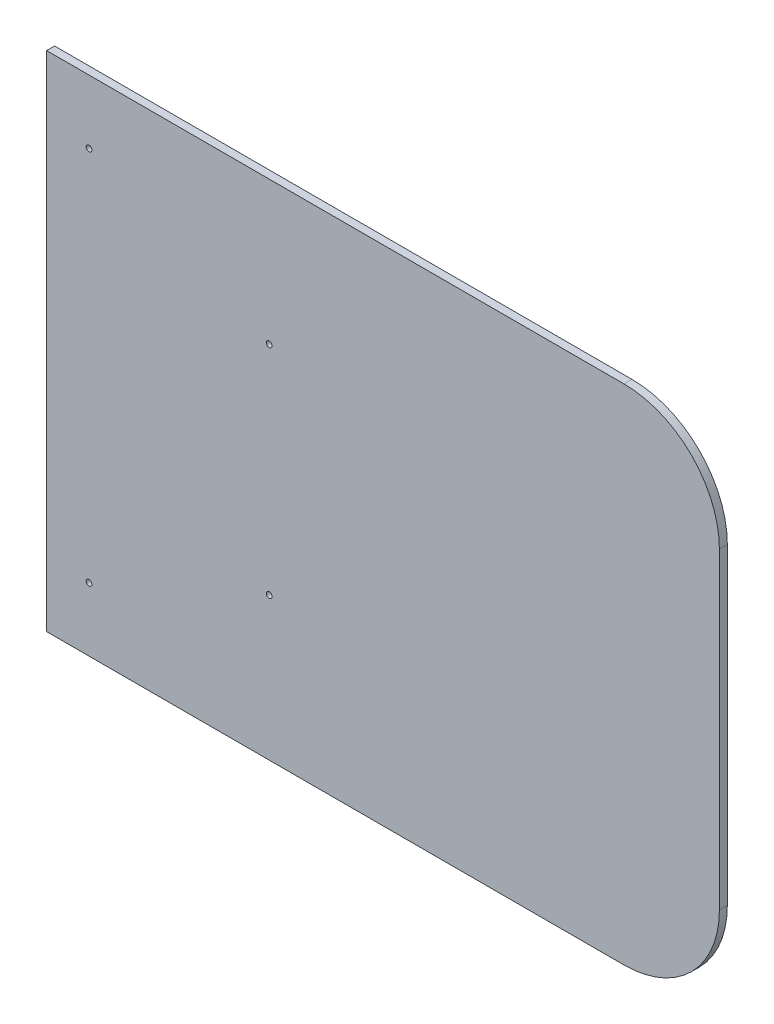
ISO-10303-21;
HEADER;
FILE_DESCRIPTION(('STEP AP214'),'2;1');
FILE_NAME('part.step','',(''),(''),'','','');
FILE_SCHEMA(('AUTOMOTIVE_DESIGN { 1 0 10303 214 1 1 1 1 }'));
ENDSEC;
DATA;
#1=APPLICATION_CONTEXT('core data for automotive mechanical design processes');
#2=APPLICATION_PROTOCOL_DEFINITION('international standard','automotive_design',2000,#1);
#3=PRODUCT_CONTEXT('',#1,'mechanical');
#4=PRODUCT('Part','Part','',(#3));
#5=PRODUCT_RELATED_PRODUCT_CATEGORY('part','',(#4));
#6=PRODUCT_DEFINITION_FORMATION('','',#4);
#7=PRODUCT_DEFINITION_CONTEXT('part definition',#1,'design');
#8=PRODUCT_DEFINITION('design','',#6,#7);
#9=PRODUCT_DEFINITION_SHAPE('','',#8);
#10=(LENGTH_UNIT() NAMED_UNIT(*) SI_UNIT(.MILLI.,.METRE.));
#11=(NAMED_UNIT(*) PLANE_ANGLE_UNIT() SI_UNIT($,.RADIAN.));
#12=(NAMED_UNIT(*) SI_UNIT($,.STERADIAN.) SOLID_ANGLE_UNIT());
#13=UNCERTAINTY_MEASURE_WITH_UNIT(LENGTH_MEASURE(1.E-05),#10,'distance_accuracy_value','');
#14=(GEOMETRIC_REPRESENTATION_CONTEXT(3) GLOBAL_UNCERTAINTY_ASSIGNED_CONTEXT((#13)) GLOBAL_UNIT_ASSIGNED_CONTEXT((#10,
#11,#12)) REPRESENTATION_CONTEXT('',''));
#15=CARTESIAN_POINT('',(0.,0.,0.));
#16=DIRECTION('',(0.,0.,1.));
#17=DIRECTION('',(1.,0.,0.));
#18=AXIS2_PLACEMENT_3D('',#15,#16,#17);
#19=CARTESIAN_POINT('',(403.225,-301.625,4.7625));
#20=DIRECTION('',(-1.,0.,0.));
#21=DIRECTION('',(0.,0.,1.));
#22=AXIS2_PLACEMENT_3D('',#19,#20,#21);
#23=PLANE('',#22);
#24=DIRECTION('',(0.,1.,0.));
#25=VECTOR('',#24,1.);
#26=CARTESIAN_POINT('',(403.225,-301.625,-4.7625));
#27=LINE('',#26,#25);
#28=CARTESIAN_POINT('',(403.225,-187.325,-4.7625));
#29=VERTEX_POINT('',#28);
#30=CARTESIAN_POINT('',(403.225,187.325,-4.7625));
#31=VERTEX_POINT('',#30);
#32=EDGE_CURVE('E113',#29,#31,#27,.T.);
#33=ORIENTED_EDGE('',*,*,#32,.T.);
#34=DIRECTION('',(0.,0.,-1.));
#35=VECTOR('',#34,1.);
#36=CARTESIAN_POINT('',(403.225,187.325,4.7625));
#37=LINE('',#36,#35);
#38=CARTESIAN_POINT('',(403.225,187.325,4.7625));
#39=VERTEX_POINT('',#38);
#40=EDGE_CURVE('E51',#31,#39,#37,.F.);
#41=ORIENTED_EDGE('',*,*,#40,.T.);
#42=DIRECTION('',(0.,1.,0.));
#43=VECTOR('',#42,1.);
#44=CARTESIAN_POINT('',(403.225,-301.625,4.7625));
#45=LINE('',#44,#43);
#46=CARTESIAN_POINT('',(403.225,-187.325,4.7625));
#47=VERTEX_POINT('',#46);
#48=EDGE_CURVE('E94',#47,#39,#45,.T.);
#49=ORIENTED_EDGE('',*,*,#48,.F.);
#50=DIRECTION('',(0.,0.,-1.));
#51=VECTOR('',#50,1.);
#52=CARTESIAN_POINT('',(403.225,-187.325,4.7625));
#53=LINE('',#52,#51);
#54=EDGE_CURVE('E127',#47,#29,#53,.T.);
#55=ORIENTED_EDGE('',*,*,#54,.T.);
#56=EDGE_LOOP('',(#33,#41,#49,#55));
#57=FACE_BOUND('',#56,.T.);
#58=ADVANCED_FACE('F30',(#57),#23,.F.);
#59=CARTESIAN_POINT('',(-403.225,301.625,4.7625));
#60=DIRECTION('',(0.,-1.,0.));
#61=DIRECTION('',(0.,0.,-1.));
#62=AXIS2_PLACEMENT_3D('',#59,#60,#61);
#63=PLANE('',#62);
#64=DIRECTION('',(-1.,0.,0.));
#65=VECTOR('',#64,1.);
#66=CARTESIAN_POINT('',(-403.225,301.625,4.7625));
#67=LINE('',#66,#65);
#68=CARTESIAN_POINT('',(288.925,301.625,4.7625));
#69=VERTEX_POINT('',#68);
#70=CARTESIAN_POINT('',(-403.225,301.625,4.7625));
#71=VERTEX_POINT('',#70);
#72=EDGE_CURVE('E84',#69,#71,#67,.T.);
#73=ORIENTED_EDGE('',*,*,#72,.F.);
#74=DIRECTION('',(0.,0.,-1.));
#75=VECTOR('',#74,1.);
#76=CARTESIAN_POINT('',(288.925,301.625,4.7625));
#77=LINE('',#76,#75);
#78=CARTESIAN_POINT('',(288.925,301.625,-4.7625));
#79=VERTEX_POINT('',#78);
#80=EDGE_CURVE('E103',#69,#79,#77,.T.);
#81=ORIENTED_EDGE('',*,*,#80,.T.);
#82=DIRECTION('',(-1.,0.,0.));
#83=VECTOR('',#82,1.);
#84=CARTESIAN_POINT('',(-403.225,301.625,-4.7625));
#85=LINE('',#84,#83);
#86=CARTESIAN_POINT('',(-403.225,301.625,-4.7625));
#87=VERTEX_POINT('',#86);
#88=EDGE_CURVE('E100',#79,#87,#85,.T.);
#89=ORIENTED_EDGE('',*,*,#88,.T.);
#90=DIRECTION('',(0.,0.,-1.));
#91=VECTOR('',#90,1.);
#92=CARTESIAN_POINT('',(-403.225,301.625,4.7625));
#93=LINE('',#92,#91);
#94=EDGE_CURVE('E97',#71,#87,#93,.T.);
#95=ORIENTED_EDGE('',*,*,#94,.F.);
#96=EDGE_LOOP('',(#73,#81,#89,#95));
#97=FACE_BOUND('',#96,.T.);
#98=ADVANCED_FACE('F98',(#97),#63,.F.);
#99=CARTESIAN_POINT('',(-403.225,-301.625,4.7625));
#100=DIRECTION('',(1.,0.,0.));
#101=DIRECTION('',(0.,0.,-1.));
#102=AXIS2_PLACEMENT_3D('',#99,#100,#101);
#103=PLANE('',#102);
#104=DIRECTION('',(0.,-1.,0.));
#105=VECTOR('',#104,1.);
#106=CARTESIAN_POINT('',(-403.225,-301.625,-4.7625));
#107=LINE('',#106,#105);
#108=CARTESIAN_POINT('',(-403.225,-301.625,-4.7625));
#109=VERTEX_POINT('',#108);
#110=EDGE_CURVE('E117',#87,#109,#107,.T.);
#111=ORIENTED_EDGE('',*,*,#110,.T.);
#112=DIRECTION('',(0.,0.,-1.));
#113=VECTOR('',#112,1.);
#114=CARTESIAN_POINT('',(-403.225,-301.625,4.7625));
#115=LINE('',#114,#113);
#116=CARTESIAN_POINT('',(-403.225,-301.625,4.7625));
#117=VERTEX_POINT('',#116);
#118=EDGE_CURVE('E104',#117,#109,#115,.T.);
#119=ORIENTED_EDGE('',*,*,#118,.F.);
#120=DIRECTION('',(0.,-1.,0.));
#121=VECTOR('',#120,1.);
#122=CARTESIAN_POINT('',(-403.225,-301.625,4.7625));
#123=LINE('',#122,#121);
#124=EDGE_CURVE('E88',#71,#117,#123,.T.);
#125=ORIENTED_EDGE('',*,*,#124,.F.);
#126=ORIENTED_EDGE('',*,*,#94,.T.);
#127=EDGE_LOOP('',(#111,#119,#125,#126));
#128=FACE_BOUND('',#127,.T.);
#129=ADVANCED_FACE('F106',(#128),#103,.F.);
#130=CARTESIAN_POINT('',(-403.225,-301.625,4.7625));
#131=DIRECTION('',(0.,1.,0.));
#132=DIRECTION('',(0.,0.,1.));
#133=AXIS2_PLACEMENT_3D('',#130,#131,#132);
#134=PLANE('',#133);
#135=DIRECTION('',(1.,0.,0.));
#136=VECTOR('',#135,1.);
#137=CARTESIAN_POINT('',(-403.225,-301.625,-4.7625));
#138=LINE('',#137,#136);
#139=CARTESIAN_POINT('',(288.925,-301.625,-4.7625));
#140=VERTEX_POINT('',#139);
#141=EDGE_CURVE('E119',#109,#140,#138,.T.);
#142=ORIENTED_EDGE('',*,*,#141,.T.);
#143=DIRECTION('',(0.,0.,-1.));
#144=VECTOR('',#143,1.);
#145=CARTESIAN_POINT('',(288.925,-301.625,4.7625));
#146=LINE('',#145,#144);
#147=CARTESIAN_POINT('',(288.925,-301.625,4.7625));
#148=VERTEX_POINT('',#147);
#149=EDGE_CURVE('E11',#140,#148,#146,.F.);
#150=ORIENTED_EDGE('',*,*,#149,.T.);
#151=DIRECTION('',(1.,0.,0.));
#152=VECTOR('',#151,1.);
#153=CARTESIAN_POINT('',(-403.225,-301.625,4.7625));
#154=LINE('',#153,#152);
#155=EDGE_CURVE('E108',#117,#148,#154,.T.);
#156=ORIENTED_EDGE('',*,*,#155,.F.);
#157=ORIENTED_EDGE('',*,*,#118,.T.);
#158=EDGE_LOOP('',(#142,#150,#156,#157));
#159=FACE_BOUND('',#158,.T.);
#160=ADVANCED_FACE('F139',(#159),#134,.F.);
#161=CARTESIAN_POINT('',(403.225,301.625,4.7625));
#162=DIRECTION('',(0.,0.,-1.));
#163=DIRECTION('',(-1.,0.,0.));
#164=AXIS2_PLACEMENT_3D('',#161,#162,#163);
#165=PLANE('',#164);
#166=CARTESIAN_POINT('',(-136.525,130.175,4.7625));
#167=DIRECTION('',(0.,0.,1.));
#168=DIRECTION('',(1.,0.,0.));
#169=AXIS2_PLACEMENT_3D('',#166,#167,#168);
#170=CIRCLE('',#169,3.429);
#171=CARTESIAN_POINT('',(-133.096,130.175,4.7625));
#172=VERTEX_POINT('',#171);
#173=EDGE_CURVE('E212',#172,#172,#170,.T.);
#174=ORIENTED_EDGE('',*,*,#173,.F.);
#175=EDGE_LOOP('',(#174));
#176=FACE_BOUND('',#175,.T.);
#177=CARTESIAN_POINT('',(-136.525,-130.175,4.7625));
#178=DIRECTION('',(0.,0.,1.));
#179=DIRECTION('',(1.,0.,0.));
#180=AXIS2_PLACEMENT_3D('',#177,#178,#179);
#181=CIRCLE('',#180,3.429);
#182=CARTESIAN_POINT('',(-133.096,-130.175,4.7625));
#183=VERTEX_POINT('',#182);
#184=EDGE_CURVE('E208',#183,#183,#181,.T.);
#185=ORIENTED_EDGE('',*,*,#184,.F.);
#186=EDGE_LOOP('',(#185));
#187=FACE_BOUND('',#186,.T.);
#188=CARTESIAN_POINT('',(-352.425,-225.425,4.7625));
#189=DIRECTION('',(0.,0.,1.));
#190=DIRECTION('',(1.,0.,0.));
#191=AXIS2_PLACEMENT_3D('',#188,#189,#190);
#192=CIRCLE('',#191,3.429);
#193=CARTESIAN_POINT('',(-348.996,-225.425,4.7625));
#194=VERTEX_POINT('',#193);
#195=EDGE_CURVE('E204',#194,#194,#192,.T.);
#196=ORIENTED_EDGE('',*,*,#195,.F.);
#197=EDGE_LOOP('',(#196));
#198=FACE_BOUND('',#197,.T.);
#199=CARTESIAN_POINT('',(-352.425,225.425,4.7625));
#200=DIRECTION('',(0.,0.,1.));
#201=DIRECTION('',(1.,0.,0.));
#202=AXIS2_PLACEMENT_3D('',#199,#200,#201);
#203=CIRCLE('',#202,3.429);
#204=CARTESIAN_POINT('',(-348.996,225.425,4.7625));
#205=VERTEX_POINT('',#204);
#206=EDGE_CURVE('E199',#205,#205,#203,.T.);
#207=ORIENTED_EDGE('',*,*,#206,.F.);
#208=EDGE_LOOP('',(#207));
#209=FACE_BOUND('',#208,.T.);
#210=ORIENTED_EDGE('',*,*,#48,.T.);
#211=CARTESIAN_POINT('',(288.925,187.325,4.7625));
#212=DIRECTION('',(0.,0.,-1.));
#213=DIRECTION('',(-1.,0.,0.));
#214=AXIS2_PLACEMENT_3D('',#211,#212,#213);
#215=CIRCLE('',#214,114.3);
#216=EDGE_CURVE('E38',#39,#69,#215,.F.);
#217=ORIENTED_EDGE('',*,*,#216,.T.);
#218=ORIENTED_EDGE('',*,*,#72,.T.);
#219=ORIENTED_EDGE('',*,*,#124,.T.);
#220=ORIENTED_EDGE('',*,*,#155,.T.);
#221=CARTESIAN_POINT('',(288.925,-187.325,4.7625));
#222=DIRECTION('',(0.,0.,-1.));
#223=DIRECTION('',(-1.,0.,0.));
#224=AXIS2_PLACEMENT_3D('',#221,#222,#223);
#225=CIRCLE('',#224,114.3);
#226=EDGE_CURVE('E131',#148,#47,#225,.F.);
#227=ORIENTED_EDGE('',*,*,#226,.T.);
#228=EDGE_LOOP('',(#210,#217,#218,#219,#220,#227));
#229=FACE_BOUND('',#228,.T.);
#230=ADVANCED_FACE('F86',(#176,#187,#198,#209,#229),#165,.F.);
#231=CARTESIAN_POINT('',(403.225,301.625,-4.7625));
#232=DIRECTION('',(0.,0.,-1.));
#233=DIRECTION('',(-1.,0.,0.));
#234=AXIS2_PLACEMENT_3D('',#231,#232,#233);
#235=PLANE('',#234);
#236=CARTESIAN_POINT('',(-136.525,130.175,-4.7625));
#237=DIRECTION('',(0.,0.,1.));
#238=DIRECTION('',(1.,0.,0.));
#239=AXIS2_PLACEMENT_3D('',#236,#237,#238);
#240=CIRCLE('',#239,3.429);
#241=CARTESIAN_POINT('',(-133.096,130.175,-4.7625));
#242=VERTEX_POINT('',#241);
#243=EDGE_CURVE('E188',#242,#242,#240,.T.);
#244=ORIENTED_EDGE('',*,*,#243,.T.);
#245=EDGE_LOOP('',(#244));
#246=FACE_BOUND('',#245,.T.);
#247=CARTESIAN_POINT('',(-136.525,-130.175,-4.7625));
#248=DIRECTION('',(0.,0.,1.));
#249=DIRECTION('',(1.,0.,0.));
#250=AXIS2_PLACEMENT_3D('',#247,#248,#249);
#251=CIRCLE('',#250,3.429);
#252=CARTESIAN_POINT('',(-133.096,-130.175,-4.7625));
#253=VERTEX_POINT('',#252);
#254=EDGE_CURVE('E192',#253,#253,#251,.T.);
#255=ORIENTED_EDGE('',*,*,#254,.T.);
#256=EDGE_LOOP('',(#255));
#257=FACE_BOUND('',#256,.T.);
#258=CARTESIAN_POINT('',(-352.425,-225.425,-4.7625));
#259=DIRECTION('',(0.,0.,1.));
#260=DIRECTION('',(1.,0.,0.));
#261=AXIS2_PLACEMENT_3D('',#258,#259,#260);
#262=CIRCLE('',#261,3.429);
#263=CARTESIAN_POINT('',(-348.996,-225.425,-4.7625));
#264=VERTEX_POINT('',#263);
#265=EDGE_CURVE('E196',#264,#264,#262,.T.);
#266=ORIENTED_EDGE('',*,*,#265,.T.);
#267=EDGE_LOOP('',(#266));
#268=FACE_BOUND('',#267,.T.);
#269=CARTESIAN_POINT('',(-352.425,225.425,-4.7625));
#270=DIRECTION('',(0.,0.,1.));
#271=DIRECTION('',(1.,0.,0.));
#272=AXIS2_PLACEMENT_3D('',#269,#270,#271);
#273=CIRCLE('',#272,3.429);
#274=CARTESIAN_POINT('',(-348.996,225.425,-4.7625));
#275=VERTEX_POINT('',#274);
#276=EDGE_CURVE('E115',#275,#275,#273,.T.);
#277=ORIENTED_EDGE('',*,*,#276,.T.);
#278=EDGE_LOOP('',(#277));
#279=FACE_BOUND('',#278,.T.);
#280=ORIENTED_EDGE('',*,*,#88,.F.);
#281=CARTESIAN_POINT('',(288.925,187.325,-4.7625));
#282=DIRECTION('',(0.,0.,-1.));
#283=DIRECTION('',(-1.,0.,0.));
#284=AXIS2_PLACEMENT_3D('',#281,#282,#283);
#285=CIRCLE('',#284,114.3);
#286=EDGE_CURVE('E125',#79,#31,#285,.T.);
#287=ORIENTED_EDGE('',*,*,#286,.T.);
#288=ORIENTED_EDGE('',*,*,#32,.F.);
#289=CARTESIAN_POINT('',(288.925,-187.325,-4.7625));
#290=DIRECTION('',(0.,0.,-1.));
#291=DIRECTION('',(-1.,0.,0.));
#292=AXIS2_PLACEMENT_3D('',#289,#290,#291);
#293=CIRCLE('',#292,114.3);
#294=EDGE_CURVE('E123',#29,#140,#293,.T.);
#295=ORIENTED_EDGE('',*,*,#294,.T.);
#296=ORIENTED_EDGE('',*,*,#141,.F.);
#297=ORIENTED_EDGE('',*,*,#110,.F.);
#298=EDGE_LOOP('',(#280,#287,#288,#295,#296,#297));
#299=FACE_BOUND('',#298,.T.);
#300=ADVANCED_FACE('F138',(#246,#257,#268,#279,#299),#235,.T.);
#301=CARTESIAN_POINT('',(-352.425,225.425,-4.7625));
#302=DIRECTION('',(0.,0.,1.));
#303=DIRECTION('',(1.,0.,0.));
#304=AXIS2_PLACEMENT_3D('',#301,#302,#303);
#305=CYLINDRICAL_SURFACE('',#304,3.429);
#306=CARTESIAN_POINT('',(-348.996,225.425,-4.7625));
#307=CARTESIAN_POINT('',(-348.996,225.425,-4.66328125));
#308=CARTESIAN_POINT('',(-348.996,225.425,-4.5640625));
#309=CARTESIAN_POINT('',(-348.996,225.425,-4.365625));
#310=CARTESIAN_POINT('',(-348.996,225.425,-4.26640625));
#311=CARTESIAN_POINT('',(-348.996,225.425,-4.06796875));
#312=CARTESIAN_POINT('',(-348.996,225.425,-3.96875));
#313=CARTESIAN_POINT('',(-348.996,225.425,-3.7703125));
#314=CARTESIAN_POINT('',(-348.996,225.425,-3.67109375));
#315=CARTESIAN_POINT('',(-348.996,225.425,-3.47265625));
#316=CARTESIAN_POINT('',(-348.996,225.425,-3.3734375));
#317=CARTESIAN_POINT('',(-348.996,225.425,-3.175));
#318=CARTESIAN_POINT('',(-348.996,225.425,-3.07578125));
#319=CARTESIAN_POINT('',(-348.996,225.425,-2.87734375));
#320=CARTESIAN_POINT('',(-348.996,225.425,-2.778125));
#321=CARTESIAN_POINT('',(-348.996,225.425,-2.5796875));
#322=CARTESIAN_POINT('',(-348.996,225.425,-2.48046875));
#323=CARTESIAN_POINT('',(-348.996,225.425,-2.28203125));
#324=CARTESIAN_POINT('',(-348.996,225.425,-2.1828125));
#325=CARTESIAN_POINT('',(-348.996,225.425,-1.984375));
#326=CARTESIAN_POINT('',(-348.996,225.425,-1.88515625));
#327=CARTESIAN_POINT('',(-348.996,225.425,-1.68671875));
#328=CARTESIAN_POINT('',(-348.996,225.425,-1.5875));
#329=CARTESIAN_POINT('',(-348.996,225.425,-1.3890625));
#330=CARTESIAN_POINT('',(-348.996,225.425,-1.28984375));
#331=CARTESIAN_POINT('',(-348.996,225.425,-1.09140625));
#332=CARTESIAN_POINT('',(-348.996,225.425,-0.9921875));
#333=CARTESIAN_POINT('',(-348.996,225.425,-0.793750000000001));
#334=CARTESIAN_POINT('',(-348.996,225.425,-0.694531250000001));
#335=CARTESIAN_POINT('',(-348.996,225.425,-0.496093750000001));
#336=CARTESIAN_POINT('',(-348.996,225.425,-0.396875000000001));
#337=CARTESIAN_POINT('',(-348.996,225.425,-0.198437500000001));
#338=CARTESIAN_POINT('',(-348.996,225.425,-0.0992187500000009));
#339=CARTESIAN_POINT('',(-348.996,225.425,0.0992187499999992));
#340=CARTESIAN_POINT('',(-348.996,225.425,0.198437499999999));
#341=CARTESIAN_POINT('',(-348.996,225.425,0.396874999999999));
#342=CARTESIAN_POINT('',(-348.996,225.425,0.496093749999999));
#343=CARTESIAN_POINT('',(-348.996,225.425,0.694531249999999));
#344=CARTESIAN_POINT('',(-348.996,225.425,0.79375));
#345=CARTESIAN_POINT('',(-348.996,225.425,0.9921875));
#346=CARTESIAN_POINT('',(-348.996,225.425,1.09140625));
#347=CARTESIAN_POINT('',(-348.996,225.425,1.28984375));
#348=CARTESIAN_POINT('',(-348.996,225.425,1.3890625));
#349=CARTESIAN_POINT('',(-348.996,225.425,1.5875));
#350=CARTESIAN_POINT('',(-348.996,225.425,1.68671875));
#351=CARTESIAN_POINT('',(-348.996,225.425,1.88515625));
#352=CARTESIAN_POINT('',(-348.996,225.425,1.984375));
#353=CARTESIAN_POINT('',(-348.996,225.425,2.1828125));
#354=CARTESIAN_POINT('',(-348.996,225.425,2.28203125));
#355=CARTESIAN_POINT('',(-348.996,225.425,2.48046875));
#356=CARTESIAN_POINT('',(-348.996,225.425,2.5796875));
#357=CARTESIAN_POINT('',(-348.996,225.425,2.778125));
#358=CARTESIAN_POINT('',(-348.996,225.425,2.87734375));
#359=CARTESIAN_POINT('',(-348.996,225.425,3.07578125));
#360=CARTESIAN_POINT('',(-348.996,225.425,3.175));
#361=CARTESIAN_POINT('',(-348.996,225.425,3.3734375));
#362=CARTESIAN_POINT('',(-348.996,225.425,3.47265625));
#363=CARTESIAN_POINT('',(-348.996,225.425,3.67109375));
#364=CARTESIAN_POINT('',(-348.996,225.425,3.7703125));
#365=CARTESIAN_POINT('',(-348.996,225.425,3.96875));
#366=CARTESIAN_POINT('',(-348.996,225.425,4.06796875));
#367=CARTESIAN_POINT('',(-348.996,225.425,4.26640625));
#368=CARTESIAN_POINT('',(-348.996,225.425,4.365625));
#369=CARTESIAN_POINT('',(-348.996,225.425,4.5640625));
#370=CARTESIAN_POINT('',(-348.996,225.425,4.66328125));
#371=CARTESIAN_POINT('',(-348.996,225.425,4.7625));
#372=B_SPLINE_CURVE_WITH_KNOTS('',3,(#306,#307,#308,#309,#310,#311,#312,#313,#314,#315,#316,
#317,#318,#319,#320,#321,#322,#323,#324,#325,#326,#327,#328,#329,#330,#331,#332,#333,#334,#335,
#336,#337,#338,#339,#340,#341,#342,#343,#344,#345,#346,#347,#348,#349,#350,#351,#352,#353,#354,
#355,#356,#357,#358,#359,#360,#361,#362,#363,#364,#365,#366,#367,#368,#369,#370,#371),
.UNSPECIFIED.,.F.,.F.,(4,2,2,2,2,2,2,2,2,2,2,2,2,2,2,2,2,2,2,2,2,2,2,2,2,2,2,2,2,2,2,2,4),(0.,
0.29765625,0.5953125,0.892968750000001,1.190625,1.48828125,1.7859375,2.08359375,2.38125,
2.67890625,2.9765625,3.27421875,3.571875,3.86953125,4.1671875,4.46484375,4.7625,5.06015625,
5.3578125,5.65546875,5.953125,6.25078125,6.5484375,6.84609375,7.14375,7.44140625,7.7390625,
8.03671875,8.334375,8.63203125,8.9296875,9.22734375,9.525),.UNSPECIFIED.);
#373=EDGE_CURVE('BSEAM178',#275,#205,#372,.T.);
#374=ORIENTED_EDGE('',*,*,#276,.F.);
#375=ORIENTED_EDGE('',*,*,#206,.T.);
#376=ORIENTED_EDGE('',*,*,#373,.T.);
#377=ORIENTED_EDGE('',*,*,#373,.F.);
#378=EDGE_LOOP('',(#374,#376,#375,#377));
#379=FACE_BOUND('',#378,.T.);
#380=ADVANCED_FACE('F178',(#379),#305,.F.);
#381=CARTESIAN_POINT('',(-352.425,-225.425,-4.7625));
#382=DIRECTION('',(0.,0.,1.));
#383=DIRECTION('',(1.,0.,0.));
#384=AXIS2_PLACEMENT_3D('',#381,#382,#383);
#385=CYLINDRICAL_SURFACE('',#384,3.429);
#386=CARTESIAN_POINT('',(-348.996,-225.425,-4.7625));
#387=CARTESIAN_POINT('',(-348.996,-225.425,-4.66328125));
#388=CARTESIAN_POINT('',(-348.996,-225.425,-4.5640625));
#389=CARTESIAN_POINT('',(-348.996,-225.425,-4.365625));
#390=CARTESIAN_POINT('',(-348.996,-225.425,-4.26640625));
#391=CARTESIAN_POINT('',(-348.996,-225.425,-4.06796875));
#392=CARTESIAN_POINT('',(-348.996,-225.425,-3.96875));
#393=CARTESIAN_POINT('',(-348.996,-225.425,-3.7703125));
#394=CARTESIAN_POINT('',(-348.996,-225.425,-3.67109375));
#395=CARTESIAN_POINT('',(-348.996,-225.425,-3.47265625));
#396=CARTESIAN_POINT('',(-348.996,-225.425,-3.3734375));
#397=CARTESIAN_POINT('',(-348.996,-225.425,-3.175));
#398=CARTESIAN_POINT('',(-348.996,-225.425,-3.07578125));
#399=CARTESIAN_POINT('',(-348.996,-225.425,-2.87734375));
#400=CARTESIAN_POINT('',(-348.996,-225.425,-2.778125));
#401=CARTESIAN_POINT('',(-348.996,-225.425,-2.5796875));
#402=CARTESIAN_POINT('',(-348.996,-225.425,-2.48046875));
#403=CARTESIAN_POINT('',(-348.996,-225.425,-2.28203125));
#404=CARTESIAN_POINT('',(-348.996,-225.425,-2.1828125));
#405=CARTESIAN_POINT('',(-348.996,-225.425,-1.984375));
#406=CARTESIAN_POINT('',(-348.996,-225.425,-1.88515625));
#407=CARTESIAN_POINT('',(-348.996,-225.425,-1.68671875));
#408=CARTESIAN_POINT('',(-348.996,-225.425,-1.5875));
#409=CARTESIAN_POINT('',(-348.996,-225.425,-1.3890625));
#410=CARTESIAN_POINT('',(-348.996,-225.425,-1.28984375));
#411=CARTESIAN_POINT('',(-348.996,-225.425,-1.09140625));
#412=CARTESIAN_POINT('',(-348.996,-225.425,-0.9921875));
#413=CARTESIAN_POINT('',(-348.996,-225.425,-0.793750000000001));
#414=CARTESIAN_POINT('',(-348.996,-225.425,-0.694531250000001));
#415=CARTESIAN_POINT('',(-348.996,-225.425,-0.496093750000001));
#416=CARTESIAN_POINT('',(-348.996,-225.425,-0.396875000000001));
#417=CARTESIAN_POINT('',(-348.996,-225.425,-0.198437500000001));
#418=CARTESIAN_POINT('',(-348.996,-225.425,-0.0992187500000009));
#419=CARTESIAN_POINT('',(-348.996,-225.425,0.0992187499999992));
#420=CARTESIAN_POINT('',(-348.996,-225.425,0.198437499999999));
#421=CARTESIAN_POINT('',(-348.996,-225.425,0.396874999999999));
#422=CARTESIAN_POINT('',(-348.996,-225.425,0.496093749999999));
#423=CARTESIAN_POINT('',(-348.996,-225.425,0.694531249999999));
#424=CARTESIAN_POINT('',(-348.996,-225.425,0.79375));
#425=CARTESIAN_POINT('',(-348.996,-225.425,0.9921875));
#426=CARTESIAN_POINT('',(-348.996,-225.425,1.09140625));
#427=CARTESIAN_POINT('',(-348.996,-225.425,1.28984375));
#428=CARTESIAN_POINT('',(-348.996,-225.425,1.3890625));
#429=CARTESIAN_POINT('',(-348.996,-225.425,1.5875));
#430=CARTESIAN_POINT('',(-348.996,-225.425,1.68671875));
#431=CARTESIAN_POINT('',(-348.996,-225.425,1.88515625));
#432=CARTESIAN_POINT('',(-348.996,-225.425,1.984375));
#433=CARTESIAN_POINT('',(-348.996,-225.425,2.1828125));
#434=CARTESIAN_POINT('',(-348.996,-225.425,2.28203125));
#435=CARTESIAN_POINT('',(-348.996,-225.425,2.48046875));
#436=CARTESIAN_POINT('',(-348.996,-225.425,2.5796875));
#437=CARTESIAN_POINT('',(-348.996,-225.425,2.778125));
#438=CARTESIAN_POINT('',(-348.996,-225.425,2.87734375));
#439=CARTESIAN_POINT('',(-348.996,-225.425,3.07578125));
#440=CARTESIAN_POINT('',(-348.996,-225.425,3.175));
#441=CARTESIAN_POINT('',(-348.996,-225.425,3.3734375));
#442=CARTESIAN_POINT('',(-348.996,-225.425,3.47265625));
#443=CARTESIAN_POINT('',(-348.996,-225.425,3.67109375));
#444=CARTESIAN_POINT('',(-348.996,-225.425,3.7703125));
#445=CARTESIAN_POINT('',(-348.996,-225.425,3.96875));
#446=CARTESIAN_POINT('',(-348.996,-225.425,4.06796875));
#447=CARTESIAN_POINT('',(-348.996,-225.425,4.26640625));
#448=CARTESIAN_POINT('',(-348.996,-225.425,4.365625));
#449=CARTESIAN_POINT('',(-348.996,-225.425,4.5640625));
#450=CARTESIAN_POINT('',(-348.996,-225.425,4.66328125));
#451=CARTESIAN_POINT('',(-348.996,-225.425,4.7625));
#452=B_SPLINE_CURVE_WITH_KNOTS('',3,(#386,#387,#388,#389,#390,#391,#392,#393,#394,#395,#396,
#397,#398,#399,#400,#401,#402,#403,#404,#405,#406,#407,#408,#409,#410,#411,#412,#413,#414,#415,
#416,#417,#418,#419,#420,#421,#422,#423,#424,#425,#426,#427,#428,#429,#430,#431,#432,#433,#434,
#435,#436,#437,#438,#439,#440,#441,#442,#443,#444,#445,#446,#447,#448,#449,#450,#451),
.UNSPECIFIED.,.F.,.F.,(4,2,2,2,2,2,2,2,2,2,2,2,2,2,2,2,2,2,2,2,2,2,2,2,2,2,2,2,2,2,2,2,4),(0.,
0.29765625,0.5953125,0.892968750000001,1.190625,1.48828125,1.7859375,2.08359375,2.38125,
2.67890625,2.9765625,3.27421875,3.571875,3.86953125,4.1671875,4.46484375,4.7625,5.06015625,
5.3578125,5.65546875,5.953125,6.25078125,6.5484375,6.84609375,7.14375,7.44140625,7.7390625,
8.03671875,8.334375,8.63203125,8.9296875,9.22734375,9.525),.UNSPECIFIED.);
#453=EDGE_CURVE('BSEAM170',#264,#194,#452,.T.);
#454=ORIENTED_EDGE('',*,*,#265,.F.);
#455=ORIENTED_EDGE('',*,*,#195,.T.);
#456=ORIENTED_EDGE('',*,*,#453,.T.);
#457=ORIENTED_EDGE('',*,*,#453,.F.);
#458=EDGE_LOOP('',(#454,#456,#455,#457));
#459=FACE_BOUND('',#458,.T.);
#460=ADVANCED_FACE('F170',(#459),#385,.F.);
#461=CARTESIAN_POINT('',(-136.525,-130.175,-4.7625));
#462=DIRECTION('',(0.,0.,1.));
#463=DIRECTION('',(1.,0.,0.));
#464=AXIS2_PLACEMENT_3D('',#461,#462,#463);
#465=CYLINDRICAL_SURFACE('',#464,3.429);
#466=CARTESIAN_POINT('',(-133.096,-130.175,-4.7625));
#467=CARTESIAN_POINT('',(-133.096,-130.175,-4.66328125));
#468=CARTESIAN_POINT('',(-133.096,-130.175,-4.5640625));
#469=CARTESIAN_POINT('',(-133.096,-130.175,-4.365625));
#470=CARTESIAN_POINT('',(-133.096,-130.175,-4.26640625));
#471=CARTESIAN_POINT('',(-133.096,-130.175,-4.06796875));
#472=CARTESIAN_POINT('',(-133.096,-130.175,-3.96875));
#473=CARTESIAN_POINT('',(-133.096,-130.175,-3.7703125));
#474=CARTESIAN_POINT('',(-133.096,-130.175,-3.67109375));
#475=CARTESIAN_POINT('',(-133.096,-130.175,-3.47265625));
#476=CARTESIAN_POINT('',(-133.096,-130.175,-3.3734375));
#477=CARTESIAN_POINT('',(-133.096,-130.175,-3.175));
#478=CARTESIAN_POINT('',(-133.096,-130.175,-3.07578125));
#479=CARTESIAN_POINT('',(-133.096,-130.175,-2.87734375));
#480=CARTESIAN_POINT('',(-133.096,-130.175,-2.778125));
#481=CARTESIAN_POINT('',(-133.096,-130.175,-2.5796875));
#482=CARTESIAN_POINT('',(-133.096,-130.175,-2.48046875));
#483=CARTESIAN_POINT('',(-133.096,-130.175,-2.28203125));
#484=CARTESIAN_POINT('',(-133.096,-130.175,-2.1828125));
#485=CARTESIAN_POINT('',(-133.096,-130.175,-1.984375));
#486=CARTESIAN_POINT('',(-133.096,-130.175,-1.88515625));
#487=CARTESIAN_POINT('',(-133.096,-130.175,-1.68671875));
#488=CARTESIAN_POINT('',(-133.096,-130.175,-1.5875));
#489=CARTESIAN_POINT('',(-133.096,-130.175,-1.3890625));
#490=CARTESIAN_POINT('',(-133.096,-130.175,-1.28984375));
#491=CARTESIAN_POINT('',(-133.096,-130.175,-1.09140625));
#492=CARTESIAN_POINT('',(-133.096,-130.175,-0.9921875));
#493=CARTESIAN_POINT('',(-133.096,-130.175,-0.793750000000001));
#494=CARTESIAN_POINT('',(-133.096,-130.175,-0.694531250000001));
#495=CARTESIAN_POINT('',(-133.096,-130.175,-0.496093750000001));
#496=CARTESIAN_POINT('',(-133.096,-130.175,-0.396875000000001));
#497=CARTESIAN_POINT('',(-133.096,-130.175,-0.198437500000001));
#498=CARTESIAN_POINT('',(-133.096,-130.175,-0.0992187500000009));
#499=CARTESIAN_POINT('',(-133.096,-130.175,0.0992187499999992));
#500=CARTESIAN_POINT('',(-133.096,-130.175,0.198437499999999));
#501=CARTESIAN_POINT('',(-133.096,-130.175,0.396874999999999));
#502=CARTESIAN_POINT('',(-133.096,-130.175,0.496093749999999));
#503=CARTESIAN_POINT('',(-133.096,-130.175,0.694531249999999));
#504=CARTESIAN_POINT('',(-133.096,-130.175,0.79375));
#505=CARTESIAN_POINT('',(-133.096,-130.175,0.9921875));
#506=CARTESIAN_POINT('',(-133.096,-130.175,1.09140625));
#507=CARTESIAN_POINT('',(-133.096,-130.175,1.28984375));
#508=CARTESIAN_POINT('',(-133.096,-130.175,1.3890625));
#509=CARTESIAN_POINT('',(-133.096,-130.175,1.5875));
#510=CARTESIAN_POINT('',(-133.096,-130.175,1.68671875));
#511=CARTESIAN_POINT('',(-133.096,-130.175,1.88515625));
#512=CARTESIAN_POINT('',(-133.096,-130.175,1.984375));
#513=CARTESIAN_POINT('',(-133.096,-130.175,2.1828125));
#514=CARTESIAN_POINT('',(-133.096,-130.175,2.28203125));
#515=CARTESIAN_POINT('',(-133.096,-130.175,2.48046875));
#516=CARTESIAN_POINT('',(-133.096,-130.175,2.5796875));
#517=CARTESIAN_POINT('',(-133.096,-130.175,2.778125));
#518=CARTESIAN_POINT('',(-133.096,-130.175,2.87734375));
#519=CARTESIAN_POINT('',(-133.096,-130.175,3.07578125));
#520=CARTESIAN_POINT('',(-133.096,-130.175,3.175));
#521=CARTESIAN_POINT('',(-133.096,-130.175,3.3734375));
#522=CARTESIAN_POINT('',(-133.096,-130.175,3.47265625));
#523=CARTESIAN_POINT('',(-133.096,-130.175,3.67109375));
#524=CARTESIAN_POINT('',(-133.096,-130.175,3.7703125));
#525=CARTESIAN_POINT('',(-133.096,-130.175,3.96875));
#526=CARTESIAN_POINT('',(-133.096,-130.175,4.06796875));
#527=CARTESIAN_POINT('',(-133.096,-130.175,4.26640625));
#528=CARTESIAN_POINT('',(-133.096,-130.175,4.365625));
#529=CARTESIAN_POINT('',(-133.096,-130.175,4.5640625));
#530=CARTESIAN_POINT('',(-133.096,-130.175,4.66328125));
#531=CARTESIAN_POINT('',(-133.096,-130.175,4.7625));
#532=B_SPLINE_CURVE_WITH_KNOTS('',3,(#466,#467,#468,#469,#470,#471,#472,#473,#474,#475,#476,
#477,#478,#479,#480,#481,#482,#483,#484,#485,#486,#487,#488,#489,#490,#491,#492,#493,#494,#495,
#496,#497,#498,#499,#500,#501,#502,#503,#504,#505,#506,#507,#508,#509,#510,#511,#512,#513,#514,
#515,#516,#517,#518,#519,#520,#521,#522,#523,#524,#525,#526,#527,#528,#529,#530,#531),
.UNSPECIFIED.,.F.,.F.,(4,2,2,2,2,2,2,2,2,2,2,2,2,2,2,2,2,2,2,2,2,2,2,2,2,2,2,2,2,2,2,2,4),(0.,
0.29765625,0.5953125,0.892968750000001,1.190625,1.48828125,1.7859375,2.08359375,2.38125,
2.67890625,2.9765625,3.27421875,3.571875,3.86953125,4.1671875,4.46484375,4.7625,5.06015625,
5.3578125,5.65546875,5.953125,6.25078125,6.5484375,6.84609375,7.14375,7.44140625,7.7390625,
8.03671875,8.334375,8.63203125,8.9296875,9.22734375,9.525),.UNSPECIFIED.);
#533=EDGE_CURVE('BSEAM164',#253,#183,#532,.T.);
#534=ORIENTED_EDGE('',*,*,#254,.F.);
#535=ORIENTED_EDGE('',*,*,#184,.T.);
#536=ORIENTED_EDGE('',*,*,#533,.T.);
#537=ORIENTED_EDGE('',*,*,#533,.F.);
#538=EDGE_LOOP('',(#534,#536,#535,#537));
#539=FACE_BOUND('',#538,.T.);
#540=ADVANCED_FACE('F164',(#539),#465,.F.);
#541=CARTESIAN_POINT('',(-136.525,130.175,-4.7625));
#542=DIRECTION('',(0.,0.,1.));
#543=DIRECTION('',(1.,0.,0.));
#544=AXIS2_PLACEMENT_3D('',#541,#542,#543);
#545=CYLINDRICAL_SURFACE('',#544,3.429);
#546=CARTESIAN_POINT('',(-133.096,130.175,-4.7625));
#547=CARTESIAN_POINT('',(-133.096,130.175,-4.66328125));
#548=CARTESIAN_POINT('',(-133.096,130.175,-4.5640625));
#549=CARTESIAN_POINT('',(-133.096,130.175,-4.365625));
#550=CARTESIAN_POINT('',(-133.096,130.175,-4.26640625));
#551=CARTESIAN_POINT('',(-133.096,130.175,-4.06796875));
#552=CARTESIAN_POINT('',(-133.096,130.175,-3.96875));
#553=CARTESIAN_POINT('',(-133.096,130.175,-3.7703125));
#554=CARTESIAN_POINT('',(-133.096,130.175,-3.67109375));
#555=CARTESIAN_POINT('',(-133.096,130.175,-3.47265625));
#556=CARTESIAN_POINT('',(-133.096,130.175,-3.3734375));
#557=CARTESIAN_POINT('',(-133.096,130.175,-3.175));
#558=CARTESIAN_POINT('',(-133.096,130.175,-3.07578125));
#559=CARTESIAN_POINT('',(-133.096,130.175,-2.87734375));
#560=CARTESIAN_POINT('',(-133.096,130.175,-2.778125));
#561=CARTESIAN_POINT('',(-133.096,130.175,-2.5796875));
#562=CARTESIAN_POINT('',(-133.096,130.175,-2.48046875));
#563=CARTESIAN_POINT('',(-133.096,130.175,-2.28203125));
#564=CARTESIAN_POINT('',(-133.096,130.175,-2.1828125));
#565=CARTESIAN_POINT('',(-133.096,130.175,-1.984375));
#566=CARTESIAN_POINT('',(-133.096,130.175,-1.88515625));
#567=CARTESIAN_POINT('',(-133.096,130.175,-1.68671875));
#568=CARTESIAN_POINT('',(-133.096,130.175,-1.5875));
#569=CARTESIAN_POINT('',(-133.096,130.175,-1.3890625));
#570=CARTESIAN_POINT('',(-133.096,130.175,-1.28984375));
#571=CARTESIAN_POINT('',(-133.096,130.175,-1.09140625));
#572=CARTESIAN_POINT('',(-133.096,130.175,-0.9921875));
#573=CARTESIAN_POINT('',(-133.096,130.175,-0.793750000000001));
#574=CARTESIAN_POINT('',(-133.096,130.175,-0.694531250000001));
#575=CARTESIAN_POINT('',(-133.096,130.175,-0.496093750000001));
#576=CARTESIAN_POINT('',(-133.096,130.175,-0.396875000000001));
#577=CARTESIAN_POINT('',(-133.096,130.175,-0.198437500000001));
#578=CARTESIAN_POINT('',(-133.096,130.175,-0.0992187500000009));
#579=CARTESIAN_POINT('',(-133.096,130.175,0.0992187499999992));
#580=CARTESIAN_POINT('',(-133.096,130.175,0.198437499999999));
#581=CARTESIAN_POINT('',(-133.096,130.175,0.396874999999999));
#582=CARTESIAN_POINT('',(-133.096,130.175,0.496093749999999));
#583=CARTESIAN_POINT('',(-133.096,130.175,0.694531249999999));
#584=CARTESIAN_POINT('',(-133.096,130.175,0.79375));
#585=CARTESIAN_POINT('',(-133.096,130.175,0.9921875));
#586=CARTESIAN_POINT('',(-133.096,130.175,1.09140625));
#587=CARTESIAN_POINT('',(-133.096,130.175,1.28984375));
#588=CARTESIAN_POINT('',(-133.096,130.175,1.3890625));
#589=CARTESIAN_POINT('',(-133.096,130.175,1.5875));
#590=CARTESIAN_POINT('',(-133.096,130.175,1.68671875));
#591=CARTESIAN_POINT('',(-133.096,130.175,1.88515625));
#592=CARTESIAN_POINT('',(-133.096,130.175,1.984375));
#593=CARTESIAN_POINT('',(-133.096,130.175,2.1828125));
#594=CARTESIAN_POINT('',(-133.096,130.175,2.28203125));
#595=CARTESIAN_POINT('',(-133.096,130.175,2.48046875));
#596=CARTESIAN_POINT('',(-133.096,130.175,2.5796875));
#597=CARTESIAN_POINT('',(-133.096,130.175,2.778125));
#598=CARTESIAN_POINT('',(-133.096,130.175,2.87734375));
#599=CARTESIAN_POINT('',(-133.096,130.175,3.07578125));
#600=CARTESIAN_POINT('',(-133.096,130.175,3.175));
#601=CARTESIAN_POINT('',(-133.096,130.175,3.3734375));
#602=CARTESIAN_POINT('',(-133.096,130.175,3.47265625));
#603=CARTESIAN_POINT('',(-133.096,130.175,3.67109375));
#604=CARTESIAN_POINT('',(-133.096,130.175,3.7703125));
#605=CARTESIAN_POINT('',(-133.096,130.175,3.96875));
#606=CARTESIAN_POINT('',(-133.096,130.175,4.06796875));
#607=CARTESIAN_POINT('',(-133.096,130.175,4.26640625));
#608=CARTESIAN_POINT('',(-133.096,130.175,4.365625));
#609=CARTESIAN_POINT('',(-133.096,130.175,4.5640625));
#610=CARTESIAN_POINT('',(-133.096,130.175,4.66328125));
#611=CARTESIAN_POINT('',(-133.096,130.175,4.7625));
#612=B_SPLINE_CURVE_WITH_KNOTS('',3,(#546,#547,#548,#549,#550,#551,#552,#553,#554,#555,#556,
#557,#558,#559,#560,#561,#562,#563,#564,#565,#566,#567,#568,#569,#570,#571,#572,#573,#574,#575,
#576,#577,#578,#579,#580,#581,#582,#583,#584,#585,#586,#587,#588,#589,#590,#591,#592,#593,#594,
#595,#596,#597,#598,#599,#600,#601,#602,#603,#604,#605,#606,#607,#608,#609,#610,#611),
.UNSPECIFIED.,.F.,.F.,(4,2,2,2,2,2,2,2,2,2,2,2,2,2,2,2,2,2,2,2,2,2,2,2,2,2,2,2,2,2,2,2,4),(0.,
0.29765625,0.5953125,0.892968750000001,1.190625,1.48828125,1.7859375,2.08359375,2.38125,
2.67890625,2.9765625,3.27421875,3.571875,3.86953125,4.1671875,4.46484375,4.7625,5.06015625,
5.3578125,5.65546875,5.953125,6.25078125,6.5484375,6.84609375,7.14375,7.44140625,7.7390625,
8.03671875,8.334375,8.63203125,8.9296875,9.22734375,9.525),.UNSPECIFIED.);
#613=EDGE_CURVE('BSEAM158',#242,#172,#612,.T.);
#614=ORIENTED_EDGE('',*,*,#243,.F.);
#615=ORIENTED_EDGE('',*,*,#173,.T.);
#616=ORIENTED_EDGE('',*,*,#613,.T.);
#617=ORIENTED_EDGE('',*,*,#613,.F.);
#618=EDGE_LOOP('',(#614,#616,#615,#617));
#619=FACE_BOUND('',#618,.T.);
#620=ADVANCED_FACE('F158',(#619),#545,.F.);
#621=CARTESIAN_POINT('',(288.925,187.325,4.7625));
#622=DIRECTION('',(0.,0.,-1.));
#623=DIRECTION('',(-1.,0.,0.));
#624=AXIS2_PLACEMENT_3D('',#621,#622,#623);
#625=CYLINDRICAL_SURFACE('',#624,114.3);
#626=ORIENTED_EDGE('',*,*,#216,.F.);
#627=ORIENTED_EDGE('',*,*,#40,.F.);
#628=ORIENTED_EDGE('',*,*,#286,.F.);
#629=ORIENTED_EDGE('',*,*,#80,.F.);
#630=EDGE_LOOP('',(#626,#627,#628,#629));
#631=FACE_BOUND('',#630,.T.);
#632=ADVANCED_FACE('F156',(#631),#625,.T.);
#633=CARTESIAN_POINT('',(288.925,-187.325,4.7625));
#634=DIRECTION('',(0.,0.,-1.));
#635=DIRECTION('',(-1.,0.,0.));
#636=AXIS2_PLACEMENT_3D('',#633,#634,#635);
#637=CYLINDRICAL_SURFACE('',#636,114.3);
#638=ORIENTED_EDGE('',*,*,#226,.F.);
#639=ORIENTED_EDGE('',*,*,#149,.F.);
#640=ORIENTED_EDGE('',*,*,#294,.F.);
#641=ORIENTED_EDGE('',*,*,#54,.F.);
#642=EDGE_LOOP('',(#638,#639,#640,#641));
#643=FACE_BOUND('',#642,.T.);
#644=ADVANCED_FACE('F32',(#643),#637,.T.);
#645=CLOSED_SHELL('',(#58,#98,#129,#160,#230,#300,#380,#460,#540,#620,#632,#644));
#646=MANIFOLD_SOLID_BREP('B2',#645);
#647=ADVANCED_BREP_SHAPE_REPRESENTATION('',(#18,#646),#14);
#648=SHAPE_DEFINITION_REPRESENTATION(#9,#647);
ENDSEC;
END-ISO-10303-21;
